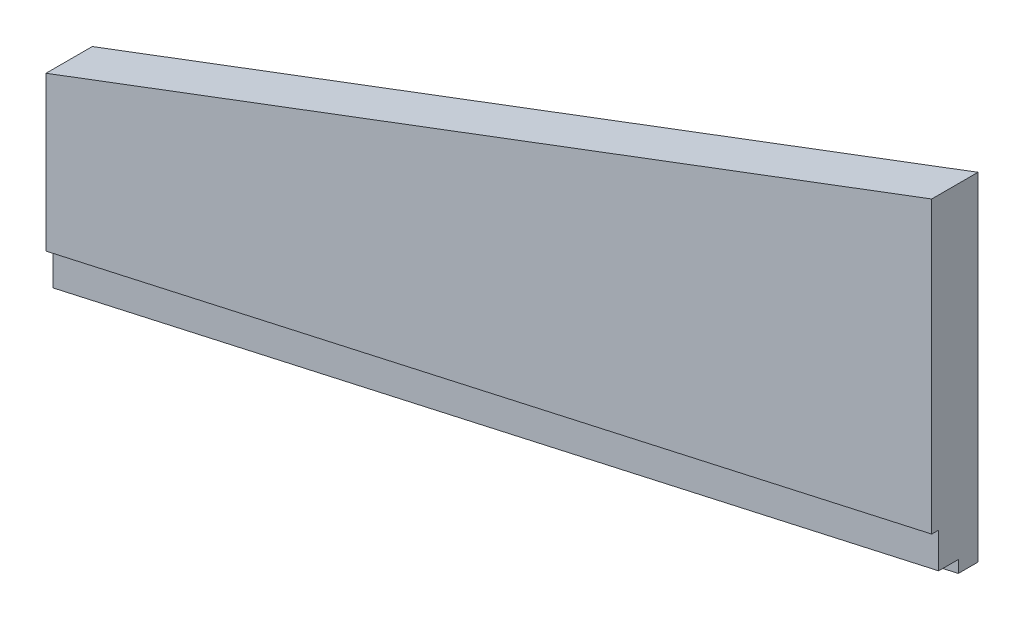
ISO-10303-21;
HEADER;
FILE_DESCRIPTION(('STEP AP214'),'2;1');
FILE_NAME('part.step','',(''),(''),'','','');
FILE_SCHEMA(('AUTOMOTIVE_DESIGN { 1 0 10303 214 1 1 1 1 }'));
ENDSEC;
DATA;
#1=APPLICATION_CONTEXT('core data for automotive mechanical design processes');
#2=APPLICATION_PROTOCOL_DEFINITION('international standard','automotive_design',2000,#1);
#3=PRODUCT_CONTEXT('',#1,'mechanical');
#4=PRODUCT('Part','Part','',(#3));
#5=PRODUCT_RELATED_PRODUCT_CATEGORY('part','',(#4));
#6=PRODUCT_DEFINITION_FORMATION('','',#4);
#7=PRODUCT_DEFINITION_CONTEXT('part definition',#1,'design');
#8=PRODUCT_DEFINITION('design','',#6,#7);
#9=PRODUCT_DEFINITION_SHAPE('','',#8);
#10=(LENGTH_UNIT() NAMED_UNIT(*) SI_UNIT(.MILLI.,.METRE.));
#11=(NAMED_UNIT(*) PLANE_ANGLE_UNIT() SI_UNIT($,.RADIAN.));
#12=(NAMED_UNIT(*) SI_UNIT($,.STERADIAN.) SOLID_ANGLE_UNIT());
#13=UNCERTAINTY_MEASURE_WITH_UNIT(LENGTH_MEASURE(1.E-05),#10,'distance_accuracy_value','');
#14=(GEOMETRIC_REPRESENTATION_CONTEXT(3) GLOBAL_UNCERTAINTY_ASSIGNED_CONTEXT((#13)) GLOBAL_UNIT_ASSIGNED_CONTEXT((#10,
#11,#12)) REPRESENTATION_CONTEXT('',''));
#15=CARTESIAN_POINT('',(0.,0.,0.));
#16=DIRECTION('',(0.,0.,1.));
#17=DIRECTION('',(1.,0.,0.));
#18=AXIS2_PLACEMENT_3D('',#15,#16,#17);
#19=CARTESIAN_POINT('',(1.14114555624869E-13,-931.846836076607,47.));
#20=DIRECTION('',(0.352820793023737,-0.935690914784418,0.));
#21=DIRECTION('',(0.935690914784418,0.352820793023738,0.));
#22=AXIS2_PLACEMENT_3D('',#19,#20,#21);
#23=PLANE('',#22);
#24=DIRECTION('',(-0.935690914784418,-0.352820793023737,0.));
#25=VECTOR('',#24,1.);
#26=CARTESIAN_POINT('',(1.14114555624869E-13,-931.846836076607,0.));
#27=LINE('',#26,#25);
#28=CARTESIAN_POINT('',(1.14114555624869E-13,-931.846836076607,0.));
#29=VERTEX_POINT('',#28);
#30=CARTESIAN_POINT('',(-900.,-1271.20966273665,0.));
#31=VERTEX_POINT('',#30);
#32=EDGE_CURVE('E100',#29,#31,#27,.T.);
#33=ORIENTED_EDGE('',*,*,#32,.T.);
#34=DIRECTION('',(0.,0.,-1.));
#35=VECTOR('',#34,1.);
#36=CARTESIAN_POINT('',(-900.,-1271.20966273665,47.));
#37=LINE('',#36,#35);
#38=CARTESIAN_POINT('',(-900.,-1271.20966273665,47.));
#39=VERTEX_POINT('',#38);
#40=EDGE_CURVE('E11',#39,#31,#37,.T.);
#41=ORIENTED_EDGE('',*,*,#40,.F.);
#42=DIRECTION('',(-0.935690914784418,-0.352820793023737,0.));
#43=VECTOR('',#42,1.);
#44=CARTESIAN_POINT('',(1.14114555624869E-13,-931.846836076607,47.));
#45=LINE('',#44,#43);
#46=CARTESIAN_POINT('',(1.14114555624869E-13,-931.846836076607,47.));
#47=VERTEX_POINT('',#46);
#48=EDGE_CURVE('E104',#47,#39,#45,.T.);
#49=ORIENTED_EDGE('',*,*,#48,.F.);
#50=DIRECTION('',(0.,0.,-1.));
#51=VECTOR('',#50,1.);
#52=CARTESIAN_POINT('',(1.14114555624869E-13,-931.846836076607,47.));
#53=LINE('',#52,#51);
#54=EDGE_CURVE('E156',#47,#29,#53,.T.);
#55=ORIENTED_EDGE('',*,*,#54,.T.);
#56=EDGE_LOOP('',(#33,#41,#49,#55));
#57=FACE_BOUND('',#56,.T.);
#58=ADVANCED_FACE('F31',(#57),#23,.F.);
#59=CARTESIAN_POINT('',(-900.,-1271.20966273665,47.));
#60=DIRECTION('',(1.,0.,0.));
#61=DIRECTION('',(0.,0.,-1.));
#62=AXIS2_PLACEMENT_3D('',#59,#60,#61);
#63=PLANE('',#62);
#64=DIRECTION('',(0.,-1.,0.));
#65=VECTOR('',#64,1.);
#66=CARTESIAN_POINT('',(-900.,-1271.20966273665,0.));
#67=LINE('',#66,#65);
#68=CARTESIAN_POINT('',(-900.,-1475.87672232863,0.));
#69=VERTEX_POINT('',#68);
#70=EDGE_CURVE('E105',#31,#69,#67,.T.);
#71=ORIENTED_EDGE('',*,*,#70,.T.);
#72=DIRECTION('',(0.,0.,-1.));
#73=VECTOR('',#72,1.);
#74=CARTESIAN_POINT('',(-900.,-1475.87672232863,20.));
#75=LINE('',#74,#73);
#76=CARTESIAN_POINT('',(-900.,-1475.87672232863,20.));
#77=VERTEX_POINT('',#76);
#78=EDGE_CURVE('E115',#77,#69,#75,.T.);
#79=ORIENTED_EDGE('',*,*,#78,.F.);
#80=DIRECTION('',(0.,1.,0.));
#81=VECTOR('',#80,1.);
#82=CARTESIAN_POINT('',(-900.,-1463.58115334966,20.));
#83=LINE('',#82,#81);
#84=CARTESIAN_POINT('',(-900.,-1463.58115334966,20.));
#85=VERTEX_POINT('',#84);
#86=EDGE_CURVE('E116',#77,#85,#83,.T.);
#87=ORIENTED_EDGE('',*,*,#86,.T.);
#88=DIRECTION('',(0.,0.,-1.));
#89=VECTOR('',#88,1.);
#90=CARTESIAN_POINT('',(-900.,-1463.58115334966,40.));
#91=LINE('',#90,#89);
#92=CARTESIAN_POINT('',(-900.,-1463.58115334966,40.));
#93=VERTEX_POINT('',#92);
#94=EDGE_CURVE('E142',#93,#85,#91,.T.);
#95=ORIENTED_EDGE('',*,*,#94,.F.);
#96=DIRECTION('',(0.,1.,0.));
#97=VECTOR('',#96,1.);
#98=CARTESIAN_POINT('',(-900.,-1427.71907716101,40.));
#99=LINE('',#98,#97);
#100=CARTESIAN_POINT('',(-900.,-1427.71907716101,40.));
#101=VERTEX_POINT('',#100);
#102=EDGE_CURVE('E138',#93,#101,#99,.T.);
#103=ORIENTED_EDGE('',*,*,#102,.T.);
#104=DIRECTION('',(0.,0.,-1.));
#105=VECTOR('',#104,1.);
#106=CARTESIAN_POINT('',(-900.,-1427.71907716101,47.));
#107=LINE('',#106,#105);
#108=CARTESIAN_POINT('',(-900.,-1427.71907716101,47.));
#109=VERTEX_POINT('',#108);
#110=EDGE_CURVE('E38',#109,#101,#107,.T.);
#111=ORIENTED_EDGE('',*,*,#110,.F.);
#112=DIRECTION('',(0.,-1.,0.));
#113=VECTOR('',#112,1.);
#114=CARTESIAN_POINT('',(-900.,-1271.20966273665,47.));
#115=LINE('',#114,#113);
#116=EDGE_CURVE('E150',#39,#109,#115,.T.);
#117=ORIENTED_EDGE('',*,*,#116,.F.);
#118=ORIENTED_EDGE('',*,*,#40,.T.);
#119=EDGE_LOOP('',(#71,#79,#87,#95,#103,#111,#117,#118));
#120=FACE_BOUND('',#119,.T.);
#121=ADVANCED_FACE('F171',(#120),#63,.F.);
#122=CARTESIAN_POINT('',(1.50227168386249E-13,-1226.73843653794,47.));
#123=DIRECTION('',(-0.217943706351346,0.975961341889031,0.));
#124=DIRECTION('',(-0.975961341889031,-0.217943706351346,0.));
#125=AXIS2_PLACEMENT_3D('',#122,#123,#124);
#126=PLANE('',#125);
#127=ORIENTED_EDGE('',*,*,#110,.T.);
#128=DIRECTION('',(0.975961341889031,0.217943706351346,0.));
#129=VECTOR('',#128,1.);
#130=CARTESIAN_POINT('',(1.50227168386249E-13,-1226.73843653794,40.));
#131=LINE('',#130,#129);
#132=CARTESIAN_POINT('',(1.50227168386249E-13,-1226.73843653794,40.));
#133=VERTEX_POINT('',#132);
#134=EDGE_CURVE('E48',#101,#133,#131,.T.);
#135=ORIENTED_EDGE('',*,*,#134,.T.);
#136=DIRECTION('',(0.,0.,-1.));
#137=VECTOR('',#136,1.);
#138=CARTESIAN_POINT('',(1.50227168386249E-13,-1226.73843653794,47.));
#139=LINE('',#138,#137);
#140=CARTESIAN_POINT('',(1.50227168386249E-13,-1226.73843653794,47.));
#141=VERTEX_POINT('',#140);
#142=EDGE_CURVE('E158',#141,#133,#139,.T.);
#143=ORIENTED_EDGE('',*,*,#142,.F.);
#144=DIRECTION('',(0.975961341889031,0.217943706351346,0.));
#145=VECTOR('',#144,1.);
#146=CARTESIAN_POINT('',(1.50227168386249E-13,-1226.73843653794,47.));
#147=LINE('',#146,#145);
#148=EDGE_CURVE('E152',#109,#141,#147,.T.);
#149=ORIENTED_EDGE('',*,*,#148,.F.);
#150=EDGE_LOOP('',(#127,#135,#143,#149));
#151=FACE_BOUND('',#150,.T.);
#152=ADVANCED_FACE('F177',(#151),#126,.F.);
#153=CARTESIAN_POINT('',(1.14114555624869E-13,-931.846836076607,47.));
#154=DIRECTION('',(-1.,0.,0.));
#155=DIRECTION('',(0.,-1.,0.));
#156=AXIS2_PLACEMENT_3D('',#153,#154,#155);
#157=PLANE('',#156);
#158=DIRECTION('',(0.,1.,0.));
#159=VECTOR('',#158,1.);
#160=CARTESIAN_POINT('',(1.14114555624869E-13,-931.846836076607,0.));
#161=LINE('',#160,#159);
#162=CARTESIAN_POINT('',(0.,-1274.89608170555,0.));
#163=VERTEX_POINT('',#162);
#164=EDGE_CURVE('E94',#163,#29,#161,.T.);
#165=ORIENTED_EDGE('',*,*,#164,.T.);
#166=ORIENTED_EDGE('',*,*,#54,.F.);
#167=DIRECTION('',(0.,1.,0.));
#168=VECTOR('',#167,1.);
#169=CARTESIAN_POINT('',(1.14114555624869E-13,-931.846836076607,47.));
#170=LINE('',#169,#168);
#171=EDGE_CURVE('E154',#141,#47,#170,.T.);
#172=ORIENTED_EDGE('',*,*,#171,.F.);
#173=ORIENTED_EDGE('',*,*,#142,.T.);
#174=DIRECTION('',(0.,-1.,0.));
#175=VECTOR('',#174,1.);
#176=CARTESIAN_POINT('',(1.50227168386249E-13,-1226.73843653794,40.));
#177=LINE('',#176,#175);
#178=CARTESIAN_POINT('',(0.,-1262.60051272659,40.));
#179=VERTEX_POINT('',#178);
#180=EDGE_CURVE('E132',#133,#179,#177,.T.);
#181=ORIENTED_EDGE('',*,*,#180,.T.);
#182=DIRECTION('',(0.,0.,-1.));
#183=VECTOR('',#182,1.);
#184=CARTESIAN_POINT('',(0.,-1262.60051272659,40.));
#185=LINE('',#184,#183);
#186=CARTESIAN_POINT('',(0.,-1262.60051272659,20.));
#187=VERTEX_POINT('',#186);
#188=EDGE_CURVE('E141',#179,#187,#185,.T.);
#189=ORIENTED_EDGE('',*,*,#188,.T.);
#190=DIRECTION('',(0.,-1.,0.));
#191=VECTOR('',#190,1.);
#192=CARTESIAN_POINT('',(0.,-1262.60051272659,20.));
#193=LINE('',#192,#191);
#194=CARTESIAN_POINT('',(0.,-1274.89608170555,20.));
#195=VERTEX_POINT('',#194);
#196=EDGE_CURVE('E111',#187,#195,#193,.T.);
#197=ORIENTED_EDGE('',*,*,#196,.T.);
#198=DIRECTION('',(0.,0.,-1.));
#199=VECTOR('',#198,1.);
#200=CARTESIAN_POINT('',(0.,-1274.89608170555,20.));
#201=LINE('',#200,#199);
#202=EDGE_CURVE('E108',#195,#163,#201,.T.);
#203=ORIENTED_EDGE('',*,*,#202,.T.);
#204=EDGE_LOOP('',(#165,#166,#172,#173,#181,#189,#197,#203));
#205=FACE_BOUND('',#204,.T.);
#206=ADVANCED_FACE('F109',(#205),#157,.F.);
#207=CARTESIAN_POINT('',(1.14114555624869E-13,-931.846836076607,47.));
#208=DIRECTION('',(0.,0.,1.));
#209=DIRECTION('',(1.,0.,0.));
#210=AXIS2_PLACEMENT_3D('',#207,#208,#209);
#211=PLANE('',#210);
#212=ORIENTED_EDGE('',*,*,#48,.T.);
#213=ORIENTED_EDGE('',*,*,#116,.T.);
#214=ORIENTED_EDGE('',*,*,#148,.T.);
#215=ORIENTED_EDGE('',*,*,#171,.T.);
#216=EDGE_LOOP('',(#212,#213,#214,#215));
#217=FACE_BOUND('',#216,.T.);
#218=ADVANCED_FACE('F176',(#217),#211,.T.);
#219=CARTESIAN_POINT('',(1.14114555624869E-13,-931.846836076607,0.));
#220=DIRECTION('',(0.,0.,1.));
#221=DIRECTION('',(1.,0.,0.));
#222=AXIS2_PLACEMENT_3D('',#219,#220,#221);
#223=PLANE('',#222);
#224=ORIENTED_EDGE('',*,*,#32,.F.);
#225=ORIENTED_EDGE('',*,*,#164,.F.);
#226=DIRECTION('',(-0.975961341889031,-0.217943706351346,0.));
#227=VECTOR('',#226,1.);
#228=CARTESIAN_POINT('',(-900.,-1475.87672232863,0.));
#229=LINE('',#228,#227);
#230=EDGE_CURVE('E98',#163,#69,#229,.T.);
#231=ORIENTED_EDGE('',*,*,#230,.T.);
#232=ORIENTED_EDGE('',*,*,#70,.F.);
#233=EDGE_LOOP('',(#224,#225,#231,#232));
#234=FACE_BOUND('',#233,.T.);
#235=ADVANCED_FACE('F96',(#234),#223,.F.);
#236=CARTESIAN_POINT('',(-900.,-1463.58115334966,40.));
#237=DIRECTION('',(0.217943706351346,-0.975961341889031,0.));
#238=DIRECTION('',(0.975961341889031,0.217943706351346,0.));
#239=AXIS2_PLACEMENT_3D('',#236,#237,#238);
#240=PLANE('',#239);
#241=DIRECTION('',(0.975961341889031,0.217943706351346,0.));
#242=VECTOR('',#241,1.);
#243=CARTESIAN_POINT('',(0.,-1262.60051272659,20.));
#244=LINE('',#243,#242);
#245=EDGE_CURVE('E120',#85,#187,#244,.T.);
#246=ORIENTED_EDGE('',*,*,#245,.T.);
#247=ORIENTED_EDGE('',*,*,#188,.F.);
#248=DIRECTION('',(-0.975961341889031,-0.217943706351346,0.));
#249=VECTOR('',#248,1.);
#250=CARTESIAN_POINT('',(-900.,-1463.58115334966,40.));
#251=LINE('',#250,#249);
#252=EDGE_CURVE('E135',#179,#93,#251,.T.);
#253=ORIENTED_EDGE('',*,*,#252,.T.);
#254=ORIENTED_EDGE('',*,*,#94,.T.);
#255=EDGE_LOOP('',(#246,#247,#253,#254));
#256=FACE_BOUND('',#255,.T.);
#257=ADVANCED_FACE('F166',(#256),#240,.T.);
#258=CARTESIAN_POINT('',(-900.,-1427.71907716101,40.));
#259=DIRECTION('',(0.,0.,1.));
#260=DIRECTION('',(1.,0.,0.));
#261=AXIS2_PLACEMENT_3D('',#258,#259,#260);
#262=PLANE('',#261);
#263=ORIENTED_EDGE('',*,*,#134,.F.);
#264=ORIENTED_EDGE('',*,*,#102,.F.);
#265=ORIENTED_EDGE('',*,*,#252,.F.);
#266=ORIENTED_EDGE('',*,*,#180,.F.);
#267=EDGE_LOOP('',(#263,#264,#265,#266));
#268=FACE_BOUND('',#267,.T.);
#269=ADVANCED_FACE('F163',(#268),#262,.T.);
#270=CARTESIAN_POINT('',(-900.,-1475.87672232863,20.));
#271=DIRECTION('',(0.217943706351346,-0.975961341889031,0.));
#272=DIRECTION('',(0.975961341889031,0.217943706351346,0.));
#273=AXIS2_PLACEMENT_3D('',#270,#271,#272);
#274=PLANE('',#273);
#275=ORIENTED_EDGE('',*,*,#230,.F.);
#276=ORIENTED_EDGE('',*,*,#202,.F.);
#277=DIRECTION('',(-0.975961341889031,-0.217943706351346,0.));
#278=VECTOR('',#277,1.);
#279=CARTESIAN_POINT('',(-900.,-1475.87672232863,20.));
#280=LINE('',#279,#278);
#281=EDGE_CURVE('E126',#195,#77,#280,.T.);
#282=ORIENTED_EDGE('',*,*,#281,.T.);
#283=ORIENTED_EDGE('',*,*,#78,.T.);
#284=EDGE_LOOP('',(#275,#276,#282,#283));
#285=FACE_BOUND('',#284,.T.);
#286=ADVANCED_FACE('F119',(#285),#274,.T.);
#287=CARTESIAN_POINT('',(0.,-1262.60051272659,20.));
#288=DIRECTION('',(0.,0.,1.));
#289=DIRECTION('',(1.,0.,0.));
#290=AXIS2_PLACEMENT_3D('',#287,#288,#289);
#291=PLANE('',#290);
#292=ORIENTED_EDGE('',*,*,#245,.F.);
#293=ORIENTED_EDGE('',*,*,#86,.F.);
#294=ORIENTED_EDGE('',*,*,#281,.F.);
#295=ORIENTED_EDGE('',*,*,#196,.F.);
#296=EDGE_LOOP('',(#292,#293,#294,#295));
#297=FACE_BOUND('',#296,.T.);
#298=ADVANCED_FACE('F169',(#297),#291,.T.);
#299=CLOSED_SHELL('',(#58,#121,#152,#206,#218,#235,#257,#269,#286,#298));
#300=MANIFOLD_SOLID_BREP('B2',#299);
#301=ADVANCED_BREP_SHAPE_REPRESENTATION('',(#18,#300),#14);
#302=SHAPE_DEFINITION_REPRESENTATION(#9,#301);
ENDSEC;
END-ISO-10303-21;
